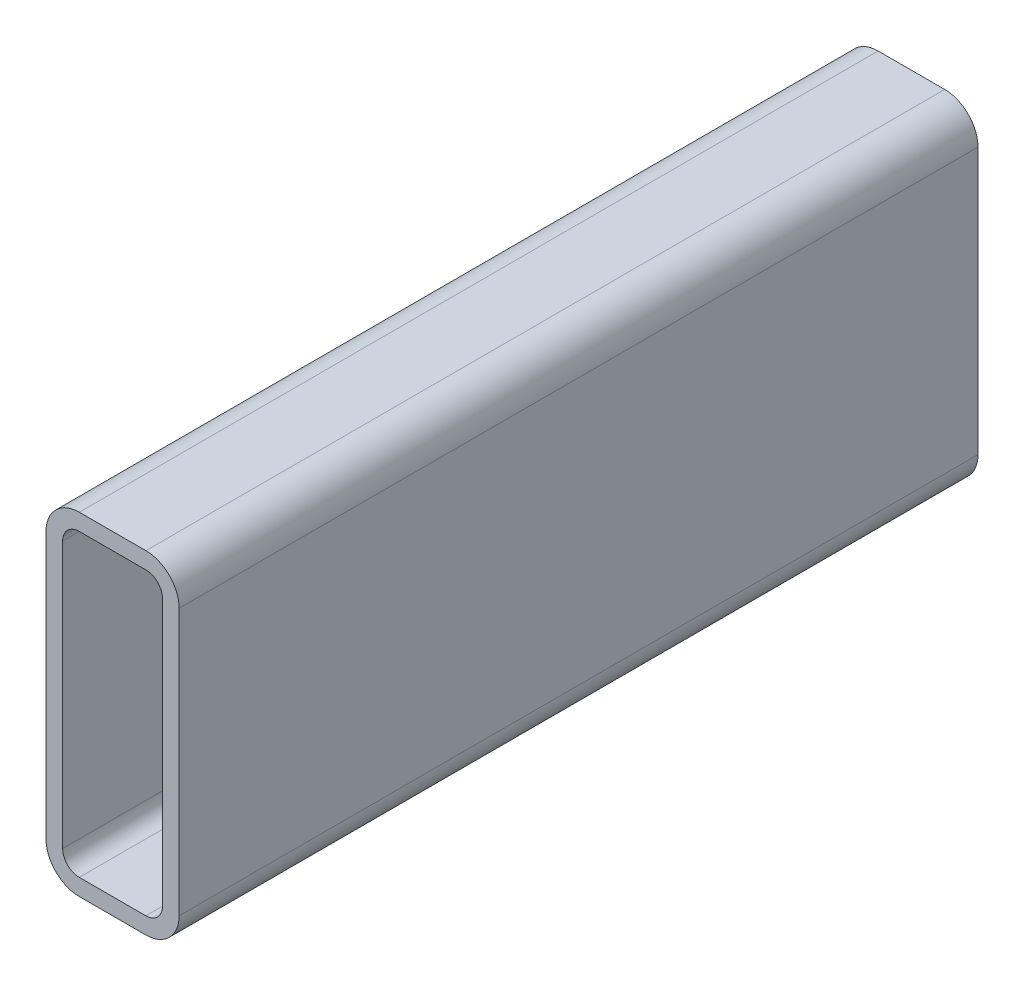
ISO-10303-21;
HEADER;
FILE_DESCRIPTION(('STEP AP214'),'2;1');
FILE_NAME('part.step','',(''),(''),'','','');
FILE_SCHEMA(('AUTOMOTIVE_DESIGN { 1 0 10303 214 1 1 1 1 }'));
ENDSEC;
DATA;
#1=APPLICATION_CONTEXT('core data for automotive mechanical design processes');
#2=APPLICATION_PROTOCOL_DEFINITION('international standard','automotive_design',2000,#1);
#3=PRODUCT_CONTEXT('',#1,'mechanical');
#4=PRODUCT('Part','Part','',(#3));
#5=PRODUCT_RELATED_PRODUCT_CATEGORY('part','',(#4));
#6=PRODUCT_DEFINITION_FORMATION('','',#4);
#7=PRODUCT_DEFINITION_CONTEXT('part definition',#1,'design');
#8=PRODUCT_DEFINITION('design','',#6,#7);
#9=PRODUCT_DEFINITION_SHAPE('','',#8);
#10=(LENGTH_UNIT() NAMED_UNIT(*) SI_UNIT(.MILLI.,.METRE.));
#11=(NAMED_UNIT(*) PLANE_ANGLE_UNIT() SI_UNIT($,.RADIAN.));
#12=(NAMED_UNIT(*) SI_UNIT($,.STERADIAN.) SOLID_ANGLE_UNIT());
#13=UNCERTAINTY_MEASURE_WITH_UNIT(LENGTH_MEASURE(1.E-05),#10,'distance_accuracy_value','');
#14=(GEOMETRIC_REPRESENTATION_CONTEXT(3) GLOBAL_UNCERTAINTY_ASSIGNED_CONTEXT((#13)) GLOBAL_UNIT_ASSIGNED_CONTEXT((#10,
#11,#12)) REPRESENTATION_CONTEXT('',''));
#15=CARTESIAN_POINT('',(0.,0.,0.));
#16=DIRECTION('',(0.,0.,1.));
#17=DIRECTION('',(1.,0.,0.));
#18=AXIS2_PLACEMENT_3D('',#15,#16,#17);
#19=CARTESIAN_POINT('',(12.7,114.3,304.8));
#20=DIRECTION('',(0.,0.,1.));
#21=DIRECTION('',(1.,0.,0.));
#22=AXIS2_PLACEMENT_3D('',#19,#20,#21);
#23=PLANE('',#22);
#24=CARTESIAN_POINT('',(12.7,114.3,304.8));
#25=DIRECTION('',(0.,0.,1.));
#26=DIRECTION('',(1.,0.,0.));
#27=AXIS2_PLACEMENT_3D('',#24,#25,#26);
#28=CIRCLE('',#27,12.7);
#29=CARTESIAN_POINT('',(12.7,127.,304.8));
#30=VERTEX_POINT('',#29);
#31=CARTESIAN_POINT('',(0.,114.3,304.8));
#32=VERTEX_POINT('',#31);
#33=EDGE_CURVE('E211',#30,#32,#28,.T.);
#34=ORIENTED_EDGE('',*,*,#33,.T.);
#35=DIRECTION('',(0.,-1.,0.));
#36=VECTOR('',#35,1.);
#37=CARTESIAN_POINT('',(0.,12.7,304.8));
#38=LINE('',#37,#36);
#39=CARTESIAN_POINT('',(0.,12.7,304.8));
#40=VERTEX_POINT('',#39);
#41=EDGE_CURVE('E214',#32,#40,#38,.T.);
#42=ORIENTED_EDGE('',*,*,#41,.T.);
#43=CARTESIAN_POINT('',(12.7,12.7,304.8));
#44=DIRECTION('',(0.,0.,1.));
#45=DIRECTION('',(1.,0.,0.));
#46=AXIS2_PLACEMENT_3D('',#43,#44,#45);
#47=CIRCLE('',#46,12.7);
#48=CARTESIAN_POINT('',(12.7,0.,304.8));
#49=VERTEX_POINT('',#48);
#50=EDGE_CURVE('E217',#40,#49,#47,.T.);
#51=ORIENTED_EDGE('',*,*,#50,.T.);
#52=DIRECTION('',(1.,0.,0.));
#53=VECTOR('',#52,1.);
#54=CARTESIAN_POINT('',(38.1,0.,304.8));
#55=LINE('',#54,#53);
#56=CARTESIAN_POINT('',(38.1,0.,304.8));
#57=VERTEX_POINT('',#56);
#58=EDGE_CURVE('E219',#49,#57,#55,.T.);
#59=ORIENTED_EDGE('',*,*,#58,.T.);
#60=CARTESIAN_POINT('',(38.1,12.7,304.8));
#61=DIRECTION('',(0.,0.,1.));
#62=DIRECTION('',(1.,0.,0.));
#63=AXIS2_PLACEMENT_3D('',#60,#61,#62);
#64=CIRCLE('',#63,12.7);
#65=CARTESIAN_POINT('',(50.8,12.7,304.8));
#66=VERTEX_POINT('',#65);
#67=EDGE_CURVE('E221',#57,#66,#64,.T.);
#68=ORIENTED_EDGE('',*,*,#67,.T.);
#69=DIRECTION('',(0.,1.,0.));
#70=VECTOR('',#69,1.);
#71=CARTESIAN_POINT('',(50.8,114.3,304.8));
#72=LINE('',#71,#70);
#73=CARTESIAN_POINT('',(50.8,114.3,304.8));
#74=VERTEX_POINT('',#73);
#75=EDGE_CURVE('E223',#66,#74,#72,.T.);
#76=ORIENTED_EDGE('',*,*,#75,.T.);
#77=CARTESIAN_POINT('',(38.1,114.3,304.8));
#78=DIRECTION('',(0.,0.,1.));
#79=DIRECTION('',(1.,0.,0.));
#80=AXIS2_PLACEMENT_3D('',#77,#78,#79);
#81=CIRCLE('',#80,12.7);
#82=CARTESIAN_POINT('',(38.1,127.,304.8));
#83=VERTEX_POINT('',#82);
#84=EDGE_CURVE('E225',#74,#83,#81,.T.);
#85=ORIENTED_EDGE('',*,*,#84,.T.);
#86=DIRECTION('',(-1.,0.,0.));
#87=VECTOR('',#86,1.);
#88=CARTESIAN_POINT('',(12.7,127.,304.8));
#89=LINE('',#88,#87);
#90=EDGE_CURVE('E227',#83,#30,#89,.T.);
#91=ORIENTED_EDGE('',*,*,#90,.T.);
#92=EDGE_LOOP('',(#34,#42,#51,#59,#68,#76,#85,#91));
#93=FACE_BOUND('',#92,.T.);
#94=DIRECTION('',(0.,-1.,0.));
#95=VECTOR('',#94,1.);
#96=CARTESIAN_POINT('',(6.35,12.7,304.8));
#97=LINE('',#96,#95);
#98=CARTESIAN_POINT('',(6.35,114.3,304.8));
#99=VERTEX_POINT('',#98);
#100=CARTESIAN_POINT('',(6.35,12.7,304.8));
#101=VERTEX_POINT('',#100);
#102=EDGE_CURVE('E154',#99,#101,#97,.T.);
#103=ORIENTED_EDGE('',*,*,#102,.F.);
#104=CARTESIAN_POINT('',(12.7,114.3,304.8));
#105=DIRECTION('',(0.,0.,1.));
#106=DIRECTION('',(1.,0.,0.));
#107=AXIS2_PLACEMENT_3D('',#104,#105,#106);
#108=CIRCLE('',#107,6.34999999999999);
#109=CARTESIAN_POINT('',(12.7,120.65,304.8));
#110=VERTEX_POINT('',#109);
#111=EDGE_CURVE('E146',#110,#99,#108,.T.);
#112=ORIENTED_EDGE('',*,*,#111,.F.);
#113=DIRECTION('',(-1.,0.,0.));
#114=VECTOR('',#113,1.);
#115=CARTESIAN_POINT('',(12.7,120.65,304.8));
#116=LINE('',#115,#114);
#117=CARTESIAN_POINT('',(38.1,120.65,304.8));
#118=VERTEX_POINT('',#117);
#119=EDGE_CURVE('E179',#118,#110,#116,.T.);
#120=ORIENTED_EDGE('',*,*,#119,.F.);
#121=CARTESIAN_POINT('',(38.1,114.3,304.8));
#122=DIRECTION('',(0.,0.,1.));
#123=DIRECTION('',(1.,0.,0.));
#124=AXIS2_PLACEMENT_3D('',#121,#122,#123);
#125=CIRCLE('',#124,6.34999999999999);
#126=CARTESIAN_POINT('',(44.45,114.3,304.8));
#127=VERTEX_POINT('',#126);
#128=EDGE_CURVE('E177',#127,#118,#125,.T.);
#129=ORIENTED_EDGE('',*,*,#128,.F.);
#130=DIRECTION('',(0.,1.,0.));
#131=VECTOR('',#130,1.);
#132=CARTESIAN_POINT('',(44.45,114.3,304.8));
#133=LINE('',#132,#131);
#134=CARTESIAN_POINT('',(44.45,12.7,304.8));
#135=VERTEX_POINT('',#134);
#136=EDGE_CURVE('E175',#135,#127,#133,.T.);
#137=ORIENTED_EDGE('',*,*,#136,.F.);
#138=CARTESIAN_POINT('',(38.1,12.7,304.8));
#139=DIRECTION('',(0.,0.,1.));
#140=DIRECTION('',(1.,0.,0.));
#141=AXIS2_PLACEMENT_3D('',#138,#139,#140);
#142=CIRCLE('',#141,6.35);
#143=CARTESIAN_POINT('',(38.1,6.35,304.8));
#144=VERTEX_POINT('',#143);
#145=EDGE_CURVE('E173',#144,#135,#142,.T.);
#146=ORIENTED_EDGE('',*,*,#145,.F.);
#147=DIRECTION('',(1.,0.,0.));
#148=VECTOR('',#147,1.);
#149=CARTESIAN_POINT('',(38.1,6.35,304.8));
#150=LINE('',#149,#148);
#151=CARTESIAN_POINT('',(12.7,6.35,304.8));
#152=VERTEX_POINT('',#151);
#153=EDGE_CURVE('E169',#152,#144,#150,.T.);
#154=ORIENTED_EDGE('',*,*,#153,.F.);
#155=CARTESIAN_POINT('',(12.7,12.7,304.8));
#156=DIRECTION('',(0.,0.,1.));
#157=DIRECTION('',(1.,0.,0.));
#158=AXIS2_PLACEMENT_3D('',#155,#156,#157);
#159=CIRCLE('',#158,6.35);
#160=EDGE_CURVE('E167',#101,#152,#159,.T.);
#161=ORIENTED_EDGE('',*,*,#160,.F.);
#162=EDGE_LOOP('',(#103,#112,#120,#129,#137,#146,#154,#161));
#163=FACE_BOUND('',#162,.T.);
#164=ADVANCED_FACE('F33',(#93,#163),#23,.T.);
#165=CARTESIAN_POINT('',(12.7,114.3,0.));
#166=DIRECTION('',(0.,0.,1.));
#167=DIRECTION('',(1.,0.,0.));
#168=AXIS2_PLACEMENT_3D('',#165,#166,#167);
#169=PLANE('',#168);
#170=CARTESIAN_POINT('',(12.7,114.3,0.));
#171=DIRECTION('',(0.,0.,1.));
#172=DIRECTION('',(1.,0.,0.));
#173=AXIS2_PLACEMENT_3D('',#170,#171,#172);
#174=CIRCLE('',#173,12.7);
#175=CARTESIAN_POINT('',(12.7,127.,0.));
#176=VERTEX_POINT('',#175);
#177=CARTESIAN_POINT('',(0.,114.3,0.));
#178=VERTEX_POINT('',#177);
#179=EDGE_CURVE('E162',#176,#178,#174,.T.);
#180=ORIENTED_EDGE('',*,*,#179,.F.);
#181=DIRECTION('',(-1.,0.,0.));
#182=VECTOR('',#181,1.);
#183=CARTESIAN_POINT('',(12.7,127.,0.));
#184=LINE('',#183,#182);
#185=CARTESIAN_POINT('',(38.1,127.,0.));
#186=VERTEX_POINT('',#185);
#187=EDGE_CURVE('E215',#186,#176,#184,.T.);
#188=ORIENTED_EDGE('',*,*,#187,.F.);
#189=CARTESIAN_POINT('',(38.1,114.3,0.));
#190=DIRECTION('',(0.,0.,1.));
#191=DIRECTION('',(1.,0.,0.));
#192=AXIS2_PLACEMENT_3D('',#189,#190,#191);
#193=CIRCLE('',#192,12.7);
#194=CARTESIAN_POINT('',(50.8,114.3,0.));
#195=VERTEX_POINT('',#194);
#196=EDGE_CURVE('E242',#195,#186,#193,.T.);
#197=ORIENTED_EDGE('',*,*,#196,.F.);
#198=DIRECTION('',(0.,1.,0.));
#199=VECTOR('',#198,1.);
#200=CARTESIAN_POINT('',(50.8,114.3,0.));
#201=LINE('',#200,#199);
#202=CARTESIAN_POINT('',(50.8,12.7,0.));
#203=VERTEX_POINT('',#202);
#204=EDGE_CURVE('E240',#203,#195,#201,.T.);
#205=ORIENTED_EDGE('',*,*,#204,.F.);
#206=CARTESIAN_POINT('',(38.1,12.7,0.));
#207=DIRECTION('',(0.,0.,1.));
#208=DIRECTION('',(1.,0.,0.));
#209=AXIS2_PLACEMENT_3D('',#206,#207,#208);
#210=CIRCLE('',#209,12.7);
#211=CARTESIAN_POINT('',(38.1,0.,0.));
#212=VERTEX_POINT('',#211);
#213=EDGE_CURVE('E238',#212,#203,#210,.T.);
#214=ORIENTED_EDGE('',*,*,#213,.F.);
#215=DIRECTION('',(1.,0.,0.));
#216=VECTOR('',#215,1.);
#217=CARTESIAN_POINT('',(38.1,0.,0.));
#218=LINE('',#217,#216);
#219=CARTESIAN_POINT('',(12.7,0.,0.));
#220=VERTEX_POINT('',#219);
#221=EDGE_CURVE('E236',#220,#212,#218,.T.);
#222=ORIENTED_EDGE('',*,*,#221,.F.);
#223=CARTESIAN_POINT('',(12.7,12.7,0.));
#224=DIRECTION('',(0.,0.,1.));
#225=DIRECTION('',(1.,0.,0.));
#226=AXIS2_PLACEMENT_3D('',#223,#224,#225);
#227=CIRCLE('',#226,12.7);
#228=CARTESIAN_POINT('',(0.,12.7,0.));
#229=VERTEX_POINT('',#228);
#230=EDGE_CURVE('E234',#229,#220,#227,.T.);
#231=ORIENTED_EDGE('',*,*,#230,.F.);
#232=DIRECTION('',(0.,-1.,0.));
#233=VECTOR('',#232,1.);
#234=CARTESIAN_POINT('',(0.,12.7,0.));
#235=LINE('',#234,#233);
#236=EDGE_CURVE('E232',#178,#229,#235,.T.);
#237=ORIENTED_EDGE('',*,*,#236,.F.);
#238=EDGE_LOOP('',(#180,#188,#197,#205,#214,#222,#231,#237));
#239=FACE_BOUND('',#238,.T.);
#240=CARTESIAN_POINT('',(12.7,114.3,0.));
#241=DIRECTION('',(0.,0.,1.));
#242=DIRECTION('',(1.,0.,0.));
#243=AXIS2_PLACEMENT_3D('',#240,#241,#242);
#244=CIRCLE('',#243,6.34999999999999);
#245=CARTESIAN_POINT('',(12.7,120.65,0.));
#246=VERTEX_POINT('',#245);
#247=CARTESIAN_POINT('',(6.35,114.3,0.));
#248=VERTEX_POINT('',#247);
#249=EDGE_CURVE('E56',#246,#248,#244,.T.);
#250=ORIENTED_EDGE('',*,*,#249,.T.);
#251=DIRECTION('',(0.,-1.,0.));
#252=VECTOR('',#251,1.);
#253=CARTESIAN_POINT('',(6.35,12.7,0.));
#254=LINE('',#253,#252);
#255=CARTESIAN_POINT('',(6.35,12.7,0.));
#256=VERTEX_POINT('',#255);
#257=EDGE_CURVE('E161',#248,#256,#254,.T.);
#258=ORIENTED_EDGE('',*,*,#257,.T.);
#259=CARTESIAN_POINT('',(12.7,12.7,0.));
#260=DIRECTION('',(0.,0.,1.));
#261=DIRECTION('',(1.,0.,0.));
#262=AXIS2_PLACEMENT_3D('',#259,#260,#261);
#263=CIRCLE('',#262,6.35);
#264=CARTESIAN_POINT('',(12.7,6.35,0.));
#265=VERTEX_POINT('',#264);
#266=EDGE_CURVE('E183',#256,#265,#263,.T.);
#267=ORIENTED_EDGE('',*,*,#266,.T.);
#268=DIRECTION('',(1.,0.,0.));
#269=VECTOR('',#268,1.);
#270=CARTESIAN_POINT('',(38.1,6.35,0.));
#271=LINE('',#270,#269);
#272=CARTESIAN_POINT('',(38.1,6.35,0.));
#273=VERTEX_POINT('',#272);
#274=EDGE_CURVE('E186',#265,#273,#271,.T.);
#275=ORIENTED_EDGE('',*,*,#274,.T.);
#276=CARTESIAN_POINT('',(38.1,12.7,0.));
#277=DIRECTION('',(0.,0.,1.));
#278=DIRECTION('',(1.,0.,0.));
#279=AXIS2_PLACEMENT_3D('',#276,#277,#278);
#280=CIRCLE('',#279,6.35);
#281=CARTESIAN_POINT('',(44.45,12.7,0.));
#282=VERTEX_POINT('',#281);
#283=EDGE_CURVE('E189',#273,#282,#280,.T.);
#284=ORIENTED_EDGE('',*,*,#283,.T.);
#285=DIRECTION('',(0.,1.,0.));
#286=VECTOR('',#285,1.);
#287=CARTESIAN_POINT('',(44.45,114.3,0.));
#288=LINE('',#287,#286);
#289=CARTESIAN_POINT('',(44.45,114.3,0.));
#290=VERTEX_POINT('',#289);
#291=EDGE_CURVE('E192',#282,#290,#288,.T.);
#292=ORIENTED_EDGE('',*,*,#291,.T.);
#293=CARTESIAN_POINT('',(38.1,114.3,0.));
#294=DIRECTION('',(0.,0.,1.));
#295=DIRECTION('',(1.,0.,0.));
#296=AXIS2_PLACEMENT_3D('',#293,#294,#295);
#297=CIRCLE('',#296,6.34999999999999);
#298=CARTESIAN_POINT('',(38.1,120.65,0.));
#299=VERTEX_POINT('',#298);
#300=EDGE_CURVE('E195',#290,#299,#297,.T.);
#301=ORIENTED_EDGE('',*,*,#300,.T.);
#302=DIRECTION('',(-1.,0.,0.));
#303=VECTOR('',#302,1.);
#304=CARTESIAN_POINT('',(12.7,120.65,0.));
#305=LINE('',#304,#303);
#306=EDGE_CURVE('E155',#299,#246,#305,.T.);
#307=ORIENTED_EDGE('',*,*,#306,.T.);
#308=EDGE_LOOP('',(#250,#258,#267,#275,#284,#292,#301,#307));
#309=FACE_BOUND('',#308,.T.);
#310=ADVANCED_FACE('F272',(#239,#309),#169,.F.);
#311=CARTESIAN_POINT('',(12.7,114.3,304.8));
#312=DIRECTION('',(0.,0.,-1.));
#313=DIRECTION('',(-1.,0.,0.));
#314=AXIS2_PLACEMENT_3D('',#311,#312,#313);
#315=CYLINDRICAL_SURFACE('',#314,12.7);
#316=ORIENTED_EDGE('',*,*,#179,.T.);
#317=DIRECTION('',(0.,0.,-1.));
#318=VECTOR('',#317,1.);
#319=CARTESIAN_POINT('',(0.,114.3,304.8));
#320=LINE('',#319,#318);
#321=EDGE_CURVE('E11',#32,#178,#320,.T.);
#322=ORIENTED_EDGE('',*,*,#321,.F.);
#323=ORIENTED_EDGE('',*,*,#33,.F.);
#324=DIRECTION('',(0.,0.,-1.));
#325=VECTOR('',#324,1.);
#326=CARTESIAN_POINT('',(12.7,127.,304.8));
#327=LINE('',#326,#325);
#328=EDGE_CURVE('E229',#30,#176,#327,.T.);
#329=ORIENTED_EDGE('',*,*,#328,.T.);
#330=EDGE_LOOP('',(#316,#322,#323,#329));
#331=FACE_BOUND('',#330,.T.);
#332=ADVANCED_FACE('F35',(#331),#315,.T.);
#333=CARTESIAN_POINT('',(0.,12.7,304.8));
#334=DIRECTION('',(1.,0.,0.));
#335=DIRECTION('',(0.,0.,-1.));
#336=AXIS2_PLACEMENT_3D('',#333,#334,#335);
#337=PLANE('',#336);
#338=ORIENTED_EDGE('',*,*,#236,.T.);
#339=DIRECTION('',(0.,0.,-1.));
#340=VECTOR('',#339,1.);
#341=CARTESIAN_POINT('',(0.,12.7,304.8));
#342=LINE('',#341,#340);
#343=EDGE_CURVE('E41',#40,#229,#342,.T.);
#344=ORIENTED_EDGE('',*,*,#343,.F.);
#345=ORIENTED_EDGE('',*,*,#41,.F.);
#346=ORIENTED_EDGE('',*,*,#321,.T.);
#347=EDGE_LOOP('',(#338,#344,#345,#346));
#348=FACE_BOUND('',#347,.T.);
#349=ADVANCED_FACE('F289',(#348),#337,.F.);
#350=CARTESIAN_POINT('',(12.7,12.7,304.8));
#351=DIRECTION('',(0.,0.,-1.));
#352=DIRECTION('',(-1.,0.,0.));
#353=AXIS2_PLACEMENT_3D('',#350,#351,#352);
#354=CYLINDRICAL_SURFACE('',#353,12.7);
#355=ORIENTED_EDGE('',*,*,#230,.T.);
#356=DIRECTION('',(0.,0.,-1.));
#357=VECTOR('',#356,1.);
#358=CARTESIAN_POINT('',(12.7,0.,304.8));
#359=LINE('',#358,#357);
#360=EDGE_CURVE('E259',#49,#220,#359,.T.);
#361=ORIENTED_EDGE('',*,*,#360,.F.);
#362=ORIENTED_EDGE('',*,*,#50,.F.);
#363=ORIENTED_EDGE('',*,*,#343,.T.);
#364=EDGE_LOOP('',(#355,#361,#362,#363));
#365=FACE_BOUND('',#364,.T.);
#366=ADVANCED_FACE('F266',(#365),#354,.T.);
#367=CARTESIAN_POINT('',(38.1,0.,304.8));
#368=DIRECTION('',(0.,1.,0.));
#369=DIRECTION('',(0.,0.,1.));
#370=AXIS2_PLACEMENT_3D('',#367,#368,#369);
#371=PLANE('',#370);
#372=ORIENTED_EDGE('',*,*,#221,.T.);
#373=DIRECTION('',(0.,0.,-1.));
#374=VECTOR('',#373,1.);
#375=CARTESIAN_POINT('',(38.1,0.,304.8));
#376=LINE('',#375,#374);
#377=EDGE_CURVE('E256',#57,#212,#376,.T.);
#378=ORIENTED_EDGE('',*,*,#377,.F.);
#379=ORIENTED_EDGE('',*,*,#58,.F.);
#380=ORIENTED_EDGE('',*,*,#360,.T.);
#381=EDGE_LOOP('',(#372,#378,#379,#380));
#382=FACE_BOUND('',#381,.T.);
#383=ADVANCED_FACE('F278',(#382),#371,.F.);
#384=CARTESIAN_POINT('',(38.1,12.7,304.8));
#385=DIRECTION('',(0.,0.,-1.));
#386=DIRECTION('',(-1.,0.,0.));
#387=AXIS2_PLACEMENT_3D('',#384,#385,#386);
#388=CYLINDRICAL_SURFACE('',#387,12.7);
#389=ORIENTED_EDGE('',*,*,#213,.T.);
#390=DIRECTION('',(0.,0.,-1.));
#391=VECTOR('',#390,1.);
#392=CARTESIAN_POINT('',(50.8,12.7,304.8));
#393=LINE('',#392,#391);
#394=EDGE_CURVE('E253',#66,#203,#393,.T.);
#395=ORIENTED_EDGE('',*,*,#394,.F.);
#396=ORIENTED_EDGE('',*,*,#67,.F.);
#397=ORIENTED_EDGE('',*,*,#377,.T.);
#398=EDGE_LOOP('',(#389,#395,#396,#397));
#399=FACE_BOUND('',#398,.T.);
#400=ADVANCED_FACE('F282',(#399),#388,.T.);
#401=CARTESIAN_POINT('',(50.8,114.3,304.8));
#402=DIRECTION('',(-1.,0.,0.));
#403=DIRECTION('',(0.,0.,1.));
#404=AXIS2_PLACEMENT_3D('',#401,#402,#403);
#405=PLANE('',#404);
#406=ORIENTED_EDGE('',*,*,#204,.T.);
#407=DIRECTION('',(0.,0.,-1.));
#408=VECTOR('',#407,1.);
#409=CARTESIAN_POINT('',(50.8,114.3,304.8));
#410=LINE('',#409,#408);
#411=EDGE_CURVE('E250',#74,#195,#410,.T.);
#412=ORIENTED_EDGE('',*,*,#411,.F.);
#413=ORIENTED_EDGE('',*,*,#75,.F.);
#414=ORIENTED_EDGE('',*,*,#394,.T.);
#415=EDGE_LOOP('',(#406,#412,#413,#414));
#416=FACE_BOUND('',#415,.T.);
#417=ADVANCED_FACE('F302',(#416),#405,.F.);
#418=CARTESIAN_POINT('',(38.1,114.3,304.8));
#419=DIRECTION('',(0.,0.,-1.));
#420=DIRECTION('',(-1.,0.,0.));
#421=AXIS2_PLACEMENT_3D('',#418,#419,#420);
#422=CYLINDRICAL_SURFACE('',#421,12.7);
#423=ORIENTED_EDGE('',*,*,#196,.T.);
#424=DIRECTION('',(0.,0.,-1.));
#425=VECTOR('',#424,1.);
#426=CARTESIAN_POINT('',(38.1,127.,304.8));
#427=LINE('',#426,#425);
#428=EDGE_CURVE('E247',#83,#186,#427,.T.);
#429=ORIENTED_EDGE('',*,*,#428,.F.);
#430=ORIENTED_EDGE('',*,*,#84,.F.);
#431=ORIENTED_EDGE('',*,*,#411,.T.);
#432=EDGE_LOOP('',(#423,#429,#430,#431));
#433=FACE_BOUND('',#432,.T.);
#434=ADVANCED_FACE('F300',(#433),#422,.T.);
#435=CARTESIAN_POINT('',(12.7,127.,304.8));
#436=DIRECTION('',(0.,-1.,0.));
#437=DIRECTION('',(0.,0.,-1.));
#438=AXIS2_PLACEMENT_3D('',#435,#436,#437);
#439=PLANE('',#438);
#440=ORIENTED_EDGE('',*,*,#187,.T.);
#441=ORIENTED_EDGE('',*,*,#328,.F.);
#442=ORIENTED_EDGE('',*,*,#90,.F.);
#443=ORIENTED_EDGE('',*,*,#428,.T.);
#444=EDGE_LOOP('',(#440,#441,#442,#443));
#445=FACE_BOUND('',#444,.T.);
#446=ADVANCED_FACE('F295',(#445),#439,.F.);
#447=CARTESIAN_POINT('',(12.7,114.3,304.8));
#448=DIRECTION('',(0.,0.,-1.));
#449=DIRECTION('',(-1.,0.,0.));
#450=AXIS2_PLACEMENT_3D('',#447,#448,#449);
#451=CYLINDRICAL_SURFACE('',#450,6.34999999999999);
#452=ORIENTED_EDGE('',*,*,#249,.F.);
#453=DIRECTION('',(0.,0.,-1.));
#454=VECTOR('',#453,1.);
#455=CARTESIAN_POINT('',(12.7,120.65,304.8));
#456=LINE('',#455,#454);
#457=EDGE_CURVE('E150',#110,#246,#456,.T.);
#458=ORIENTED_EDGE('',*,*,#457,.F.);
#459=ORIENTED_EDGE('',*,*,#111,.T.);
#460=DIRECTION('',(0.,0.,-1.));
#461=VECTOR('',#460,1.);
#462=CARTESIAN_POINT('',(6.35,114.3,304.8));
#463=LINE('',#462,#461);
#464=EDGE_CURVE('E149',#99,#248,#463,.T.);
#465=ORIENTED_EDGE('',*,*,#464,.T.);
#466=EDGE_LOOP('',(#452,#458,#459,#465));
#467=FACE_BOUND('',#466,.T.);
#468=ADVANCED_FACE('F148',(#467),#451,.F.);
#469=CARTESIAN_POINT('',(6.35,12.7,304.8));
#470=DIRECTION('',(1.,0.,0.));
#471=DIRECTION('',(0.,0.,-1.));
#472=AXIS2_PLACEMENT_3D('',#469,#470,#471);
#473=PLANE('',#472);
#474=ORIENTED_EDGE('',*,*,#257,.F.);
#475=ORIENTED_EDGE('',*,*,#464,.F.);
#476=ORIENTED_EDGE('',*,*,#102,.T.);
#477=DIRECTION('',(0.,0.,-1.));
#478=VECTOR('',#477,1.);
#479=CARTESIAN_POINT('',(6.35,12.7,304.8));
#480=LINE('',#479,#478);
#481=EDGE_CURVE('E163',#101,#256,#480,.T.);
#482=ORIENTED_EDGE('',*,*,#481,.T.);
#483=EDGE_LOOP('',(#474,#475,#476,#482));
#484=FACE_BOUND('',#483,.T.);
#485=ADVANCED_FACE('F158',(#484),#473,.T.);
#486=CARTESIAN_POINT('',(12.7,12.7,304.8));
#487=DIRECTION('',(0.,0.,-1.));
#488=DIRECTION('',(-1.,0.,0.));
#489=AXIS2_PLACEMENT_3D('',#486,#487,#488);
#490=CYLINDRICAL_SURFACE('',#489,6.35);
#491=ORIENTED_EDGE('',*,*,#266,.F.);
#492=ORIENTED_EDGE('',*,*,#481,.F.);
#493=ORIENTED_EDGE('',*,*,#160,.T.);
#494=DIRECTION('',(0.,0.,-1.));
#495=VECTOR('',#494,1.);
#496=CARTESIAN_POINT('',(12.7,6.35,304.8));
#497=LINE('',#496,#495);
#498=EDGE_CURVE('E208',#152,#265,#497,.T.);
#499=ORIENTED_EDGE('',*,*,#498,.T.);
#500=EDGE_LOOP('',(#491,#492,#493,#499));
#501=FACE_BOUND('',#500,.T.);
#502=ADVANCED_FACE('F327',(#501),#490,.F.);
#503=CARTESIAN_POINT('',(38.1,6.35,304.8));
#504=DIRECTION('',(0.,1.,0.));
#505=DIRECTION('',(0.,0.,1.));
#506=AXIS2_PLACEMENT_3D('',#503,#504,#505);
#507=PLANE('',#506);
#508=ORIENTED_EDGE('',*,*,#274,.F.);
#509=ORIENTED_EDGE('',*,*,#498,.F.);
#510=ORIENTED_EDGE('',*,*,#153,.T.);
#511=DIRECTION('',(0.,0.,-1.));
#512=VECTOR('',#511,1.);
#513=CARTESIAN_POINT('',(38.1,6.35,304.8));
#514=LINE('',#513,#512);
#515=EDGE_CURVE('E206',#144,#273,#514,.T.);
#516=ORIENTED_EDGE('',*,*,#515,.T.);
#517=EDGE_LOOP('',(#508,#509,#510,#516));
#518=FACE_BOUND('',#517,.T.);
#519=ADVANCED_FACE('F331',(#518),#507,.T.);
#520=CARTESIAN_POINT('',(38.1,12.7,304.8));
#521=DIRECTION('',(0.,0.,-1.));
#522=DIRECTION('',(-1.,0.,0.));
#523=AXIS2_PLACEMENT_3D('',#520,#521,#522);
#524=CYLINDRICAL_SURFACE('',#523,6.35);
#525=ORIENTED_EDGE('',*,*,#283,.F.);
#526=ORIENTED_EDGE('',*,*,#515,.F.);
#527=ORIENTED_EDGE('',*,*,#145,.T.);
#528=DIRECTION('',(0.,0.,-1.));
#529=VECTOR('',#528,1.);
#530=CARTESIAN_POINT('',(44.45,12.7,304.8));
#531=LINE('',#530,#529);
#532=EDGE_CURVE('E204',#135,#282,#531,.T.);
#533=ORIENTED_EDGE('',*,*,#532,.T.);
#534=EDGE_LOOP('',(#525,#526,#527,#533));
#535=FACE_BOUND('',#534,.T.);
#536=ADVANCED_FACE('F337',(#535),#524,.F.);
#537=CARTESIAN_POINT('',(44.45,114.3,304.8));
#538=DIRECTION('',(-1.,0.,0.));
#539=DIRECTION('',(0.,0.,1.));
#540=AXIS2_PLACEMENT_3D('',#537,#538,#539);
#541=PLANE('',#540);
#542=ORIENTED_EDGE('',*,*,#291,.F.);
#543=ORIENTED_EDGE('',*,*,#532,.F.);
#544=ORIENTED_EDGE('',*,*,#136,.T.);
#545=DIRECTION('',(0.,0.,-1.));
#546=VECTOR('',#545,1.);
#547=CARTESIAN_POINT('',(44.45,114.3,304.8));
#548=LINE('',#547,#546);
#549=EDGE_CURVE('E202',#127,#290,#548,.T.);
#550=ORIENTED_EDGE('',*,*,#549,.T.);
#551=EDGE_LOOP('',(#542,#543,#544,#550));
#552=FACE_BOUND('',#551,.T.);
#553=ADVANCED_FACE('F341',(#552),#541,.T.);
#554=CARTESIAN_POINT('',(38.1,114.3,304.8));
#555=DIRECTION('',(0.,0.,-1.));
#556=DIRECTION('',(-1.,0.,0.));
#557=AXIS2_PLACEMENT_3D('',#554,#555,#556);
#558=CYLINDRICAL_SURFACE('',#557,6.34999999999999);
#559=ORIENTED_EDGE('',*,*,#300,.F.);
#560=ORIENTED_EDGE('',*,*,#549,.F.);
#561=ORIENTED_EDGE('',*,*,#128,.T.);
#562=DIRECTION('',(0.,0.,-1.));
#563=VECTOR('',#562,1.);
#564=CARTESIAN_POINT('',(38.1,120.65,304.8));
#565=LINE('',#564,#563);
#566=EDGE_CURVE('E48',#118,#299,#565,.T.);
#567=ORIENTED_EDGE('',*,*,#566,.T.);
#568=EDGE_LOOP('',(#559,#560,#561,#567));
#569=FACE_BOUND('',#568,.T.);
#570=ADVANCED_FACE('F345',(#569),#558,.F.);
#571=CARTESIAN_POINT('',(12.7,120.65,304.8));
#572=DIRECTION('',(0.,-1.,0.));
#573=DIRECTION('',(0.,0.,-1.));
#574=AXIS2_PLACEMENT_3D('',#571,#572,#573);
#575=PLANE('',#574);
#576=ORIENTED_EDGE('',*,*,#306,.F.);
#577=ORIENTED_EDGE('',*,*,#566,.F.);
#578=ORIENTED_EDGE('',*,*,#119,.T.);
#579=ORIENTED_EDGE('',*,*,#457,.T.);
#580=EDGE_LOOP('',(#576,#577,#578,#579));
#581=FACE_BOUND('',#580,.T.);
#582=ADVANCED_FACE('F349',(#581),#575,.T.);
#583=CLOSED_SHELL('',(#164,#310,#332,#349,#366,#383,#400,#417,#434,#446,#468,#485,#502,#519,
#536,#553,#570,#582));
#584=MANIFOLD_SOLID_BREP('B2',#583);
#585=ADVANCED_BREP_SHAPE_REPRESENTATION('',(#18,#584),#14);
#586=SHAPE_DEFINITION_REPRESENTATION(#9,#585);
ENDSEC;
END-ISO-10303-21;
